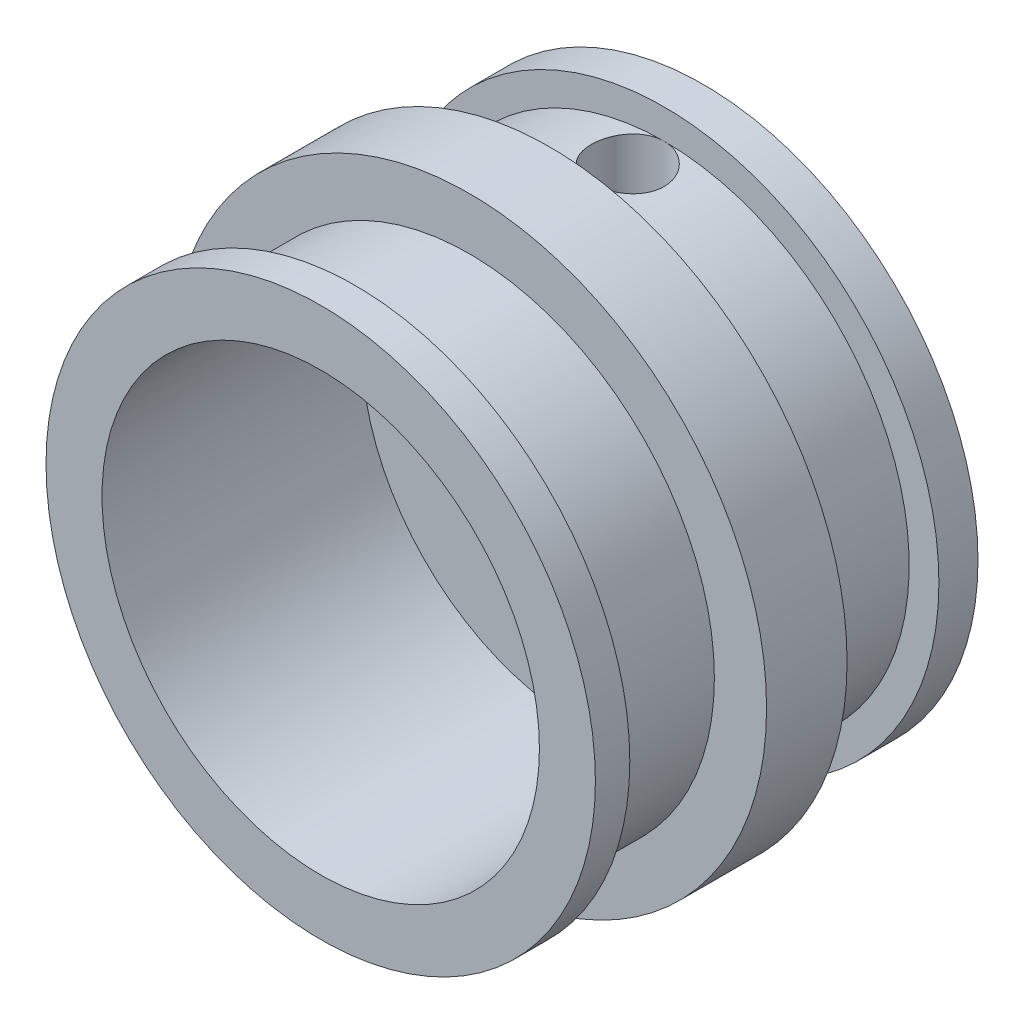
from build123d import *

# Parameters (mm, degrees)
SZKIC1_R                        = 9.42
DODANIE_WYCI_GNI_CIE1_DEPTH     = 1.34
SZKIC2_R                        = 8.4
DODANIE_WYCI_GNI_CIE2_DEPTH     = 3.92
SZKIC3_R                        = 10.19
DODANIE_WYCI_GNI_CIE3_DEPTH     = 2.76
SZKIC4_R                        = 8.4
DODANIE_WYCI_GNI_CIE4_DEPTH     = 3.92
SZKIC5_R                        = 9.42
DODANIE_WYCI_GNI_CIE5_DEPTH     = 1.18
SZKIC6_R                        = 7.5
WYTNIJ_WYCI_GNI_CIE1_DEPTH      = 8.9
WYTNIJ_WYCI_GNI_CIE2_REACH      = 21.489
SZKIC7_R                        = 1.5
WYTNIJ_WYCI_GNI_CIE3_DEPTH      = 20.488627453
WYTNIJ_WYCI_GNI_CIE3_DEPTH_BACK = 20.488627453
SZKIC8_R                        = 1.25


with BuildPart() as part:
    # Szkic1 → Dodanie-wyci_gni_cie1 (new body)
    with BuildSketch(Plane.XY):
        Circle(SZKIC1_R)
    extrude(amount=DODANIE_WYCI_GNI_CIE1_DEPTH)

    # Szkic2 → Dodanie-wyci_gni_cie2 (add)
    with BuildSketch(Plane.XY.offset(1.34)):
        Circle(SZKIC2_R)
    extrude(amount=DODANIE_WYCI_GNI_CIE2_DEPTH)

    # Szkic3 → Dodanie-wyci_gni_cie3 (add)
    with BuildSketch(Plane.XY.offset(5.26)):
        Circle(SZKIC3_R)
    extrude(amount=DODANIE_WYCI_GNI_CIE3_DEPTH)

    # Szkic4 → Dodanie-wyci_gni_cie4 (add)
    with BuildSketch(Plane.XY.offset(8.02)):
        Circle(SZKIC4_R)
    extrude(amount=DODANIE_WYCI_GNI_CIE4_DEPTH)

    # Szkic5 → Dodanie-wyci_gni_cie5 (add)
    with BuildSketch(Plane.XY.offset(11.94)):
        Circle(SZKIC5_R)
    extrude(amount=DODANIE_WYCI_GNI_CIE5_DEPTH)

    # Szkic6 → Wytnij-wyci_gni_cie1 (cut)
    with BuildSketch(Plane.XY.offset(13.12)):
        Circle(SZKIC6_R)
    extrude(amount=-WYTNIJ_WYCI_GNI_CIE1_DEPTH, mode=Mode.SUBTRACT)

    # Szkic7 → Wytnij-wyci_gni_cie2 (cut, up to next)
    with BuildSketch(Plane(origin=(0, 0, 0), x_dir=(-1, 0, 0), z_dir=(0, 0, -1)), mode=Mode.PRIVATE) as wytnij_wyci_gni_cie2_sk1:
        Circle(SZKIC7_R)
    wytnij_wyci_gni_cie2_tool1 = extrude(wytnij_wyci_gni_cie2_sk1.sketch, amount=-WYTNIJ_WYCI_GNI_CIE2_REACH, mode=Mode.PRIVATE) & part.part
    add(wytnij_wyci_gni_cie2_tool1.solids().sort_by_distance((0, 0, 0))[0], mode=Mode.SUBTRACT)

    # Szkic8 → Wytnij-wyci_gni_cie3 (cut, two sides: drawn at the far end of the back side and taken through both)
    with BuildSketch(Plane(origin=(0, 0, 0), x_dir=(1, 0, 0), z_dir=(0, 1, 0)).offset(-WYTNIJ_WYCI_GNI_CIE3_DEPTH_BACK)):
        with Locations(Location((0, -2.59, 0), (0, 0, 270))):
            Circle(SZKIC8_R)
    extrude(amount=WYTNIJ_WYCI_GNI_CIE3_DEPTH + WYTNIJ_WYCI_GNI_CIE3_DEPTH_BACK, mode=Mode.SUBTRACT)


solid = part.part
